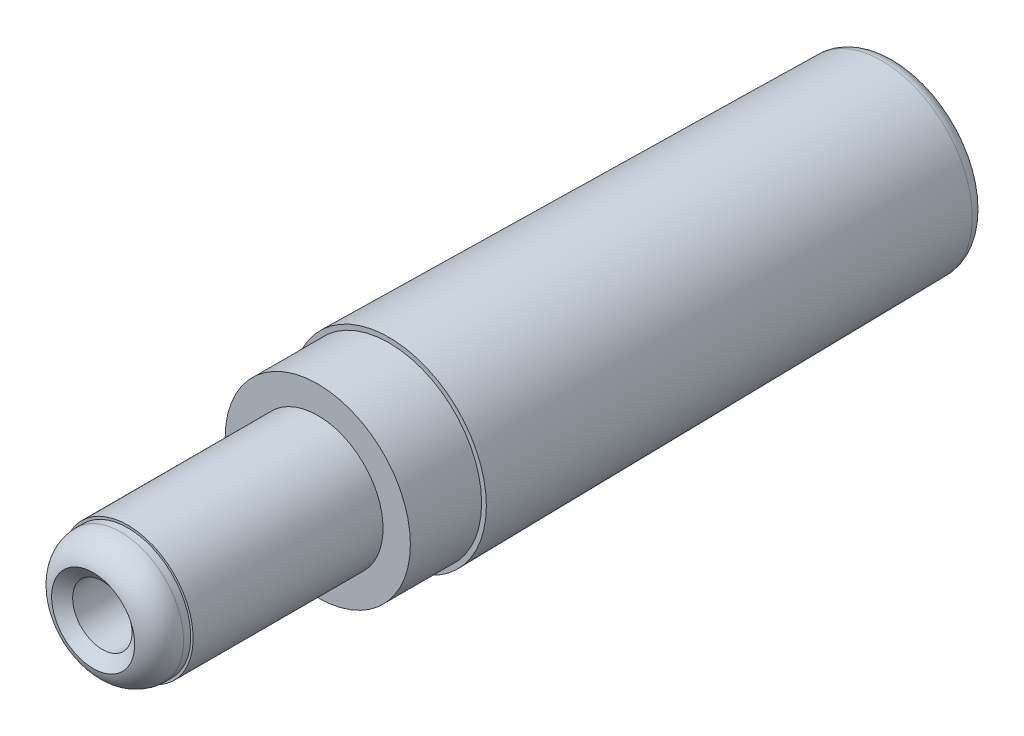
ISO-10303-21;
HEADER;
FILE_DESCRIPTION(('STEP AP214'),'2;1');
FILE_NAME('part.step','',(''),(''),'','','');
FILE_SCHEMA(('AUTOMOTIVE_DESIGN { 1 0 10303 214 1 1 1 1 }'));
ENDSEC;
DATA;
#1=APPLICATION_CONTEXT('core data for automotive mechanical design processes');
#2=APPLICATION_PROTOCOL_DEFINITION('international standard','automotive_design',2000,#1);
#3=PRODUCT_CONTEXT('',#1,'mechanical');
#4=PRODUCT('Part','Part','',(#3));
#5=PRODUCT_RELATED_PRODUCT_CATEGORY('part','',(#4));
#6=PRODUCT_DEFINITION_FORMATION('','',#4);
#7=PRODUCT_DEFINITION_CONTEXT('part definition',#1,'design');
#8=PRODUCT_DEFINITION('design','',#6,#7);
#9=PRODUCT_DEFINITION_SHAPE('','',#8);
#10=(LENGTH_UNIT() NAMED_UNIT(*) SI_UNIT(.MILLI.,.METRE.));
#11=(NAMED_UNIT(*) PLANE_ANGLE_UNIT() SI_UNIT($,.RADIAN.));
#12=(NAMED_UNIT(*) SI_UNIT($,.STERADIAN.) SOLID_ANGLE_UNIT());
#13=UNCERTAINTY_MEASURE_WITH_UNIT(LENGTH_MEASURE(1.E-05),#10,'distance_accuracy_value','');
#14=(GEOMETRIC_REPRESENTATION_CONTEXT(3) GLOBAL_UNCERTAINTY_ASSIGNED_CONTEXT((#13)) GLOBAL_UNIT_ASSIGNED_CONTEXT((#10,
#11,#12)) REPRESENTATION_CONTEXT('',''));
#15=CARTESIAN_POINT('',(0.,0.,0.));
#16=DIRECTION('',(0.,0.,1.));
#17=DIRECTION('',(1.,0.,0.));
#18=AXIS2_PLACEMENT_3D('',#15,#16,#17);
#19=CARTESIAN_POINT('',(0.,0.,2.5));
#20=DIRECTION('',(0.,0.,1.));
#21=DIRECTION('',(1.,0.,0.));
#22=AXIS2_PLACEMENT_3D('',#19,#20,#21);
#23=PLANE('',#22);
#24=CARTESIAN_POINT('',(0.,0.,2.5));
#25=DIRECTION('',(0.,0.,1.));
#26=DIRECTION('',(1.,0.,0.));
#27=AXIS2_PLACEMENT_3D('',#24,#25,#26);
#28=CIRCLE('',#27,1.25);
#29=CARTESIAN_POINT('',(1.25,0.,2.5));
#30=VERTEX_POINT('',#29);
#31=EDGE_CURVE('E46',#30,#30,#28,.T.);
#32=ORIENTED_EDGE('',*,*,#31,.T.);
#33=EDGE_LOOP('',(#32));
#34=FACE_BOUND('',#33,.T.);
#35=ADVANCED_FACE('F15',(#34),#23,.T.);
#36=CARTESIAN_POINT('',(0.,0.,2.5));
#37=DIRECTION('',(0.,0.,1.));
#38=DIRECTION('',(1.,0.,0.));
#39=AXIS2_PLACEMENT_3D('',#36,#37,#38);
#40=CYLINDRICAL_SURFACE('',#39,1.25);
#41=CARTESIAN_POINT('',(0.,0.,12.0745966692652));
#42=DIRECTION('',(0.,0.,1.));
#43=DIRECTION('',(1.,0.,0.));
#44=AXIS2_PLACEMENT_3D('',#41,#42,#43);
#45=CIRCLE('',#44,1.25000000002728);
#46=CARTESIAN_POINT('',(1.25000000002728,0.,12.0745966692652));
#47=VERTEX_POINT('',#46);
#48=EDGE_CURVE('E49',#47,#47,#45,.T.);
#49=ORIENTED_EDGE('',*,*,#48,.T.);
#50=EDGE_LOOP('',(#49));
#51=FACE_BOUND('',#50,.T.);
#52=ORIENTED_EDGE('',*,*,#31,.F.);
#53=EDGE_LOOP('',(#52));
#54=FACE_BOUND('',#53,.T.);
#55=ADVANCED_FACE('F94',(#51,#54),#40,.F.);
#56=CARTESIAN_POINT('',(0.,0.,12.4618950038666));
#57=DIRECTION('',(0.,0.,1.));
#58=DIRECTION('',(0.,-1.,0.));
#59=AXIS2_PLACEMENT_3D('',#56,#57,#58);
#60=CONICAL_SURFACE('',#59,1.74999999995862,0.911738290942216);
#61=CARTESIAN_POINT('',(0.,0.,12.4618950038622));
#62=DIRECTION('',(0.,0.,-1.));
#63=DIRECTION('',(-1.,0.,0.));
#64=AXIS2_PLACEMENT_3D('',#61,#62,#63);
#65=CIRCLE('',#64,1.75000000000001);
#66=CARTESIAN_POINT('',(-1.75000000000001,0.,12.4618950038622));
#67=VERTEX_POINT('',#66);
#68=EDGE_CURVE('E78',#67,#67,#65,.T.);
#69=ORIENTED_EDGE('',*,*,#68,.F.);
#70=EDGE_LOOP('',(#69));
#71=FACE_BOUND('',#70,.T.);
#72=ORIENTED_EDGE('',*,*,#48,.F.);
#73=EDGE_LOOP('',(#72));
#74=FACE_BOUND('',#73,.T.);
#75=ADVANCED_FACE('F90',(#71,#74),#60,.F.);
#76=CARTESIAN_POINT('',(0.,0.,11.3));
#77=DIRECTION('',(0.,0.,-1.));
#78=DIRECTION('',(-1.,0.,0.));
#79=AXIS2_PLACEMENT_3D('',#76,#77,#78);
#80=TOROIDAL_SURFACE('',#79,1.45,1.2);
#81=ORIENTED_EDGE('',*,*,#68,.T.);
#82=EDGE_LOOP('',(#81));
#83=FACE_BOUND('',#82,.T.);
#84=CARTESIAN_POINT('',(0.,0.,11.3));
#85=DIRECTION('',(0.,0.,-1.));
#86=DIRECTION('',(-1.,0.,0.));
#87=AXIS2_PLACEMENT_3D('',#84,#85,#86);
#88=CIRCLE('',#87,2.65);
#89=CARTESIAN_POINT('',(-2.65,0.,11.3));
#90=VERTEX_POINT('',#89);
#91=EDGE_CURVE('E54',#90,#90,#88,.T.);
#92=ORIENTED_EDGE('',*,*,#91,.F.);
#93=EDGE_LOOP('',(#92));
#94=FACE_BOUND('',#93,.T.);
#95=ADVANCED_FACE('F85',(#83,#94),#80,.T.);
#96=CARTESIAN_POINT('',(0.,0.,0.));
#97=DIRECTION('',(0.,0.,-1.));
#98=DIRECTION('',(-1.,0.,0.));
#99=AXIS2_PLACEMENT_3D('',#96,#97,#98);
#100=PLANE('',#99);
#101=CARTESIAN_POINT('',(0.,0.,0.));
#102=DIRECTION('',(0.,0.,1.));
#103=DIRECTION('',(1.,0.,0.));
#104=AXIS2_PLACEMENT_3D('',#101,#102,#103);
#105=CIRCLE('',#104,2.9);
#106=CARTESIAN_POINT('',(2.9,0.,0.));
#107=VERTEX_POINT('',#106);
#108=EDGE_CURVE('E50',#107,#107,#105,.F.);
#109=ORIENTED_EDGE('',*,*,#108,.T.);
#110=EDGE_LOOP('',(#109));
#111=FACE_BOUND('',#110,.T.);
#112=ADVANCED_FACE('F89',(#111),#100,.T.);
#113=CARTESIAN_POINT('',(0.,0.,0.));
#114=DIRECTION('',(0.,0.,-1.));
#115=DIRECTION('',(-1.,0.,0.));
#116=AXIS2_PLACEMENT_3D('',#113,#114,#115);
#117=CYLINDRICAL_SURFACE('',#116,2.65);
#118=ORIENTED_EDGE('',*,*,#91,.T.);
#119=EDGE_LOOP('',(#118));
#120=FACE_BOUND('',#119,.T.);
#121=CARTESIAN_POINT('',(0.,0.,11.));
#122=DIRECTION('',(0.,0.,-1.));
#123=DIRECTION('',(-1.,0.,0.));
#124=AXIS2_PLACEMENT_3D('',#121,#122,#123);
#125=CIRCLE('',#124,2.65);
#126=CARTESIAN_POINT('',(-2.65,0.,11.));
#127=VERTEX_POINT('',#126);
#128=EDGE_CURVE('E53',#127,#127,#125,.T.);
#129=ORIENTED_EDGE('',*,*,#128,.F.);
#130=EDGE_LOOP('',(#129));
#131=FACE_BOUND('',#130,.T.);
#132=ADVANCED_FACE('F173',(#120,#131),#117,.T.);
#133=CARTESIAN_POINT('',(0.,0.,9.61752107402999));
#134=DIRECTION('',(0.,0.,1.));
#135=DIRECTION('',(1.,0.,0.));
#136=AXIS2_PLACEMENT_3D('',#133,#134,#135);
#137=CYLINDRICAL_SURFACE('',#136,2.9);
#138=CARTESIAN_POINT('',(0.,0.,-19.45));
#139=DIRECTION('',(0.,0.,1.));
#140=DIRECTION('',(1.,0.,0.));
#141=AXIS2_PLACEMENT_3D('',#138,#139,#140);
#142=CIRCLE('',#141,2.9);
#143=CARTESIAN_POINT('',(2.9,0.,-19.45));
#144=VERTEX_POINT('',#143);
#145=EDGE_CURVE('E57',#144,#144,#142,.F.);
#146=ORIENTED_EDGE('',*,*,#145,.T.);
#147=EDGE_LOOP('',(#146));
#148=FACE_BOUND('',#147,.T.);
#149=ORIENTED_EDGE('',*,*,#108,.F.);
#150=EDGE_LOOP('',(#149));
#151=FACE_BOUND('',#150,.T.);
#152=ADVANCED_FACE('F170',(#148,#151),#137,.F.);
#153=CARTESIAN_POINT('',(0.,2.75,11.));
#154=DIRECTION('',(0.,0.,1.));
#155=DIRECTION('',(1.,0.,0.));
#156=AXIS2_PLACEMENT_3D('',#153,#154,#155);
#157=PLANE('',#156);
#158=CARTESIAN_POINT('',(0.,0.,11.));
#159=DIRECTION('',(0.,0.,-1.));
#160=DIRECTION('',(-1.,0.,0.));
#161=AXIS2_PLACEMENT_3D('',#158,#159,#160);
#162=CIRCLE('',#161,2.75);
#163=CARTESIAN_POINT('',(-2.75,0.,11.));
#164=VERTEX_POINT('',#163);
#165=EDGE_CURVE('E60',#164,#164,#162,.T.);
#166=ORIENTED_EDGE('',*,*,#165,.F.);
#167=EDGE_LOOP('',(#166));
#168=FACE_BOUND('',#167,.T.);
#169=ORIENTED_EDGE('',*,*,#128,.T.);
#170=EDGE_LOOP('',(#169));
#171=FACE_BOUND('',#170,.T.);
#172=ADVANCED_FACE('F166',(#168,#171),#157,.T.);
#173=CARTESIAN_POINT('',(0.,2.,-19.45));
#174=DIRECTION('',(0.,0.,-1.));
#175=DIRECTION('',(-1.,0.,0.));
#176=AXIS2_PLACEMENT_3D('',#173,#174,#175);
#177=PLANE('',#176);
#178=ORIENTED_EDGE('',*,*,#145,.F.);
#179=EDGE_LOOP('',(#178));
#180=FACE_BOUND('',#179,.T.);
#181=CARTESIAN_POINT('',(0.,0.,-19.45));
#182=DIRECTION('',(0.,0.,1.));
#183=DIRECTION('',(1.,0.,0.));
#184=AXIS2_PLACEMENT_3D('',#181,#182,#183);
#185=CIRCLE('',#184,2.);
#186=CARTESIAN_POINT('',(2.,0.,-19.45));
#187=VERTEX_POINT('',#186);
#188=EDGE_CURVE('E63',#187,#187,#185,.F.);
#189=ORIENTED_EDGE('',*,*,#188,.T.);
#190=EDGE_LOOP('',(#189));
#191=FACE_BOUND('',#190,.T.);
#192=ADVANCED_FACE('F162',(#180,#191),#177,.F.);
#193=CARTESIAN_POINT('',(0.,0.,0.));
#194=DIRECTION('',(0.,0.,-1.));
#195=DIRECTION('',(-1.,0.,0.));
#196=AXIS2_PLACEMENT_3D('',#193,#194,#195);
#197=CYLINDRICAL_SURFACE('',#196,2.75);
#198=ORIENTED_EDGE('',*,*,#165,.T.);
#199=EDGE_LOOP('',(#198));
#200=FACE_BOUND('',#199,.T.);
#201=CARTESIAN_POINT('',(0.,0.,3.));
#202=DIRECTION('',(0.,0.,-1.));
#203=DIRECTION('',(-1.,0.,0.));
#204=AXIS2_PLACEMENT_3D('',#201,#202,#203);
#205=CIRCLE('',#204,2.75);
#206=CARTESIAN_POINT('',(-2.75,0.,3.));
#207=VERTEX_POINT('',#206);
#208=EDGE_CURVE('E66',#207,#207,#205,.T.);
#209=ORIENTED_EDGE('',*,*,#208,.F.);
#210=EDGE_LOOP('',(#209));
#211=FACE_BOUND('',#210,.T.);
#212=ADVANCED_FACE('F158',(#200,#211),#197,.T.);
#213=CARTESIAN_POINT('',(0.,0.,9.61752107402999));
#214=DIRECTION('',(0.,0.,1.));
#215=DIRECTION('',(1.,0.,0.));
#216=AXIS2_PLACEMENT_3D('',#213,#214,#215);
#217=CYLINDRICAL_SURFACE('',#216,2.);
#218=CARTESIAN_POINT('',(0.,0.,-21.35));
#219=DIRECTION('',(0.,0.,1.));
#220=DIRECTION('',(1.,0.,0.));
#221=AXIS2_PLACEMENT_3D('',#218,#219,#220);
#222=CIRCLE('',#221,2.);
#223=CARTESIAN_POINT('',(2.,0.,-21.35));
#224=VERTEX_POINT('',#223);
#225=EDGE_CURVE('E69',#224,#224,#222,.F.);
#226=ORIENTED_EDGE('',*,*,#225,.T.);
#227=EDGE_LOOP('',(#226));
#228=FACE_BOUND('',#227,.T.);
#229=ORIENTED_EDGE('',*,*,#188,.F.);
#230=EDGE_LOOP('',(#229));
#231=FACE_BOUND('',#230,.T.);
#232=ADVANCED_FACE('F154',(#228,#231),#217,.F.);
#233=CARTESIAN_POINT('',(0.,3.9,3.));
#234=DIRECTION('',(0.,0.,1.));
#235=DIRECTION('',(1.,0.,0.));
#236=AXIS2_PLACEMENT_3D('',#233,#234,#235);
#237=PLANE('',#236);
#238=CARTESIAN_POINT('',(0.,0.,3.));
#239=DIRECTION('',(0.,0.,-1.));
#240=DIRECTION('',(-1.,0.,0.));
#241=AXIS2_PLACEMENT_3D('',#238,#239,#240);
#242=CIRCLE('',#241,3.9);
#243=CARTESIAN_POINT('',(-3.9,0.,3.));
#244=VERTEX_POINT('',#243);
#245=EDGE_CURVE('E44',#244,#244,#242,.T.);
#246=ORIENTED_EDGE('',*,*,#245,.F.);
#247=EDGE_LOOP('',(#246));
#248=FACE_BOUND('',#247,.T.);
#249=ORIENTED_EDGE('',*,*,#208,.T.);
#250=EDGE_LOOP('',(#249));
#251=FACE_BOUND('',#250,.T.);
#252=ADVANCED_FACE('F135',(#248,#251),#237,.T.);
#253=CARTESIAN_POINT('',(0.,3.20837168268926,-21.35));
#254=DIRECTION('',(0.,0.,1.));
#255=DIRECTION('',(1.,0.,0.));
#256=AXIS2_PLACEMENT_3D('',#253,#254,#255);
#257=PLANE('',#256);
#258=ORIENTED_EDGE('',*,*,#225,.F.);
#259=EDGE_LOOP('',(#258));
#260=FACE_BOUND('',#259,.T.);
#261=CARTESIAN_POINT('',(0.,0.,-21.35));
#262=DIRECTION('',(0.,0.,1.));
#263=DIRECTION('',(-1.,0.,0.));
#264=AXIS2_PLACEMENT_3D('',#261,#262,#263);
#265=CIRCLE('',#264,3.20837168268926);
#266=CARTESIAN_POINT('',(-3.20837168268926,0.,-21.35));
#267=VERTEX_POINT('',#266);
#268=CARTESIAN_POINT('',(3.20837168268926,0.,-21.35));
#269=VERTEX_POINT('',#268);
#270=EDGE_CURVE('E32',#267,#269,#265,.T.);
#271=ORIENTED_EDGE('',*,*,#270,.F.);
#272=CARTESIAN_POINT('',(0.,0.,-21.35));
#273=DIRECTION('',(0.,0.,1.));
#274=DIRECTION('',(1.,0.,0.));
#275=AXIS2_PLACEMENT_3D('',#272,#273,#274);
#276=CIRCLE('',#275,3.20837168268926);
#277=EDGE_CURVE('E35',#269,#267,#276,.T.);
#278=ORIENTED_EDGE('',*,*,#277,.F.);
#279=EDGE_LOOP('',(#271,#278));
#280=FACE_BOUND('',#279,.T.);
#281=ADVANCED_FACE('F37',(#260,#280),#257,.F.);
#282=CARTESIAN_POINT('',(0.,0.,0.));
#283=DIRECTION('',(0.,0.,-1.));
#284=DIRECTION('',(-1.,0.,0.));
#285=AXIS2_PLACEMENT_3D('',#282,#283,#284);
#286=CYLINDRICAL_SURFACE('',#285,3.9);
#287=CARTESIAN_POINT('',(0.,0.,0.));
#288=DIRECTION('',(0.,0.,-1.));
#289=DIRECTION('',(-1.,0.,0.));
#290=AXIS2_PLACEMENT_3D('',#287,#288,#289);
#291=CIRCLE('',#290,3.9);
#292=CARTESIAN_POINT('',(-3.9,0.,0.));
#293=VERTEX_POINT('',#292);
#294=EDGE_CURVE('E40',#293,#293,#291,.F.);
#295=ORIENTED_EDGE('',*,*,#294,.T.);
#296=EDGE_LOOP('',(#295));
#297=FACE_BOUND('',#296,.T.);
#298=ORIENTED_EDGE('',*,*,#245,.T.);
#299=EDGE_LOOP('',(#298));
#300=FACE_BOUND('',#299,.T.);
#301=ADVANCED_FACE('F119',(#297,#300),#286,.T.);
#302=CARTESIAN_POINT('',(0.,0.,-20.75));
#303=DIRECTION('',(0.,0.,1.));
#304=DIRECTION('',(1.,0.,0.));
#305=AXIS2_PLACEMENT_3D('',#302,#303,#304);
#306=TOROIDAL_SURFACE('',#305,3.20837168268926,0.6);
#307=CARTESIAN_POINT('',(0.,0.,-20.7584300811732));
#308=DIRECTION('',(0.,0.,1.));
#309=DIRECTION('',(1.,0.,0.));
#310=AXIS2_PLACEMENT_3D('',#307,#308,#309);
#311=CIRCLE('',#310,3.80831245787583);
#312=CARTESIAN_POINT('',(3.80831245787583,0.,-20.7584300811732));
#313=VERTEX_POINT('',#312);
#314=EDGE_CURVE('E25',#313,#313,#311,.T.);
#315=ORIENTED_EDGE('',*,*,#314,.F.);
#316=EDGE_LOOP('',(#315));
#317=FACE_BOUND('',#316,.T.);
#318=ORIENTED_EDGE('',*,*,#277,.T.);
#319=ORIENTED_EDGE('',*,*,#270,.T.);
#320=EDGE_LOOP('',(#318,#319));
#321=FACE_BOUND('',#320,.T.);
#322=ADVANCED_FACE('F43',(#317,#321),#306,.T.);
#323=CARTESIAN_POINT('',(0.,2.9,0.));
#324=DIRECTION('',(0.,0.,-1.));
#325=DIRECTION('',(-1.,0.,0.));
#326=AXIS2_PLACEMENT_3D('',#323,#324,#325);
#327=PLANE('',#326);
#328=CARTESIAN_POINT('',(0.,0.,0.));
#329=DIRECTION('',(0.,0.,1.));
#330=DIRECTION('',(1.,0.,0.));
#331=AXIS2_PLACEMENT_3D('',#328,#329,#330);
#332=CIRCLE('',#331,4.09999999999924);
#333=CARTESIAN_POINT('',(4.09999999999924,0.,0.));
#334=VERTEX_POINT('',#333);
#335=EDGE_CURVE('E10',#334,#334,#332,.F.);
#336=ORIENTED_EDGE('',*,*,#335,.F.);
#337=EDGE_LOOP('',(#336));
#338=FACE_BOUND('',#337,.T.);
#339=ORIENTED_EDGE('',*,*,#294,.F.);
#340=EDGE_LOOP('',(#339));
#341=FACE_BOUND('',#340,.T.);
#342=ADVANCED_FACE('F106',(#338,#341),#327,.F.);
#343=CARTESIAN_POINT('',(0.,0.,-5.6843418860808E-11));
#344=DIRECTION('',(0.,0.,1.));
#345=DIRECTION('',(1.,0.,0.));
#346=AXIS2_PLACEMENT_3D('',#343,#344,#345);
#347=CONICAL_SURFACE('',#346,4.09999999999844,0.0140505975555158);
#348=ORIENTED_EDGE('',*,*,#335,.T.);
#349=EDGE_LOOP('',(#348));
#350=FACE_BOUND('',#349,.T.);
#351=ORIENTED_EDGE('',*,*,#314,.T.);
#352=EDGE_LOOP('',(#351));
#353=FACE_BOUND('',#352,.T.);
#354=ADVANCED_FACE('F104',(#350,#353),#347,.T.);
#355=CLOSED_SHELL('',(#35,#55,#75,#95,#112,#132,#152,#172,#192,#212,#232,#252,#281,#301,#322,
#342,#354));
#356=MANIFOLD_SOLID_BREP('B1',#355);
#357=ADVANCED_BREP_SHAPE_REPRESENTATION('',(#18,#356),#14);
#358=SHAPE_DEFINITION_REPRESENTATION(#9,#357);
ENDSEC;
END-ISO-10303-21;
